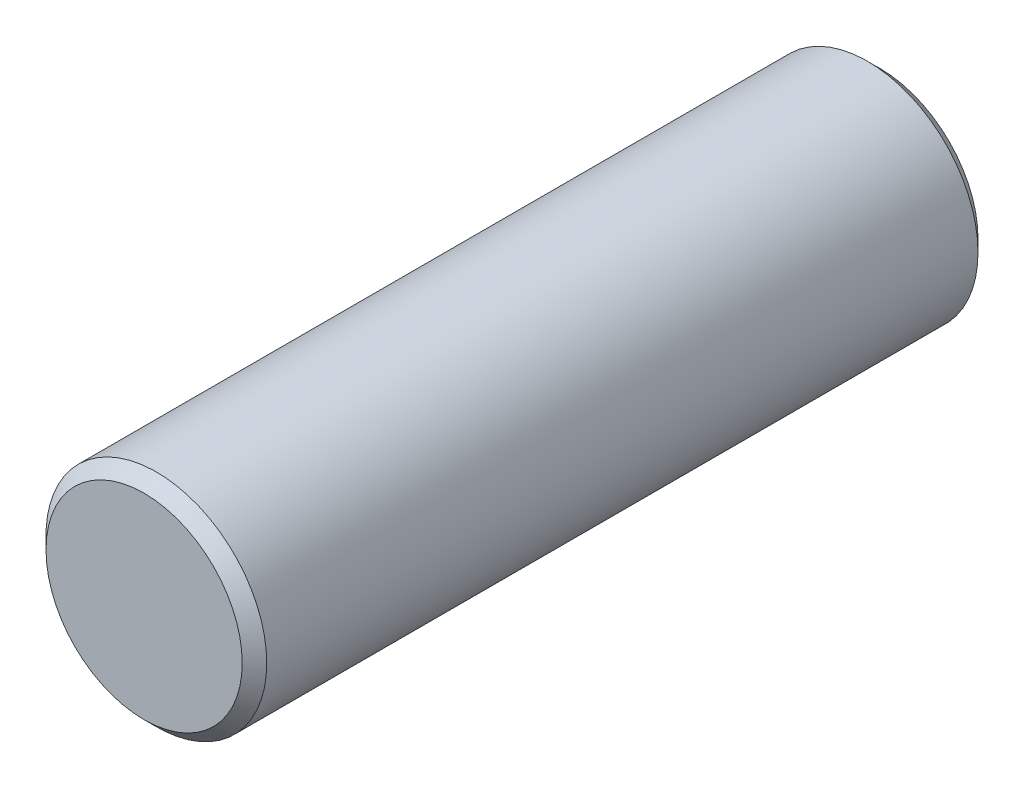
ISO-10303-21;
HEADER;
FILE_DESCRIPTION(('STEP AP214'),'2;1');
FILE_NAME('part.step','',(''),(''),'','','');
FILE_SCHEMA(('AUTOMOTIVE_DESIGN { 1 0 10303 214 1 1 1 1 }'));
ENDSEC;
DATA;
#1=APPLICATION_CONTEXT('core data for automotive mechanical design processes');
#2=APPLICATION_PROTOCOL_DEFINITION('international standard','automotive_design',2000,#1);
#3=PRODUCT_CONTEXT('',#1,'mechanical');
#4=PRODUCT('Part','Part','',(#3));
#5=PRODUCT_RELATED_PRODUCT_CATEGORY('part','',(#4));
#6=PRODUCT_DEFINITION_FORMATION('','',#4);
#7=PRODUCT_DEFINITION_CONTEXT('part definition',#1,'design');
#8=PRODUCT_DEFINITION('design','',#6,#7);
#9=PRODUCT_DEFINITION_SHAPE('','',#8);
#10=(LENGTH_UNIT() NAMED_UNIT(*) SI_UNIT(.MILLI.,.METRE.));
#11=(NAMED_UNIT(*) PLANE_ANGLE_UNIT() SI_UNIT($,.RADIAN.));
#12=(NAMED_UNIT(*) SI_UNIT($,.STERADIAN.) SOLID_ANGLE_UNIT());
#13=UNCERTAINTY_MEASURE_WITH_UNIT(LENGTH_MEASURE(1.E-05),#10,'distance_accuracy_value','');
#14=(GEOMETRIC_REPRESENTATION_CONTEXT(3) GLOBAL_UNCERTAINTY_ASSIGNED_CONTEXT((#13)) GLOBAL_UNIT_ASSIGNED_CONTEXT((#10,
#11,#12)) REPRESENTATION_CONTEXT('',''));
#15=CARTESIAN_POINT('',(0.,0.,0.));
#16=DIRECTION('',(0.,0.,1.));
#17=DIRECTION('',(1.,0.,0.));
#18=AXIS2_PLACEMENT_3D('',#15,#16,#17);
#19=CARTESIAN_POINT('',(0.,0.,60.));
#20=DIRECTION('',(0.,0.,-1.));
#21=DIRECTION('',(-1.,0.,0.));
#22=AXIS2_PLACEMENT_3D('',#19,#20,#21);
#23=CYLINDRICAL_SURFACE('',#22,9.);
#24=CARTESIAN_POINT('',(0.,0.,1.00000000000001));
#25=DIRECTION('',(0.,0.,1.));
#26=DIRECTION('',(1.,0.,0.));
#27=AXIS2_PLACEMENT_3D('',#24,#25,#26);
#28=CIRCLE('',#27,9.);
#29=CARTESIAN_POINT('',(9.,0.,1.00000000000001));
#30=VERTEX_POINT('',#29);
#31=EDGE_CURVE('E39',#30,#30,#28,.T.);
#32=ORIENTED_EDGE('',*,*,#31,.T.);
#33=EDGE_LOOP('',(#32));
#34=FACE_BOUND('',#33,.T.);
#35=CARTESIAN_POINT('',(0.,0.,59.));
#36=DIRECTION('',(0.,0.,1.));
#37=DIRECTION('',(1.,0.,0.));
#38=AXIS2_PLACEMENT_3D('',#35,#36,#37);
#39=CIRCLE('',#38,9.);
#40=CARTESIAN_POINT('',(9.,0.,59.));
#41=VERTEX_POINT('',#40);
#42=EDGE_CURVE('E43',#41,#41,#39,.F.);
#43=ORIENTED_EDGE('',*,*,#42,.T.);
#44=EDGE_LOOP('',(#43));
#45=FACE_BOUND('',#44,.T.);
#46=ADVANCED_FACE('F28',(#34,#45),#23,.T.);
#47=CARTESIAN_POINT('',(0.,0.,60.));
#48=DIRECTION('',(0.,0.,1.));
#49=DIRECTION('',(1.,0.,0.));
#50=AXIS2_PLACEMENT_3D('',#47,#48,#49);
#51=PLANE('',#50);
#52=CARTESIAN_POINT('',(0.,0.,60.));
#53=DIRECTION('',(0.,0.,1.));
#54=DIRECTION('',(1.,0.,0.));
#55=AXIS2_PLACEMENT_3D('',#52,#53,#54);
#56=CIRCLE('',#55,8.00000000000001);
#57=CARTESIAN_POINT('',(8.00000000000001,0.,60.));
#58=VERTEX_POINT('',#57);
#59=EDGE_CURVE('E10',#58,#58,#56,.T.);
#60=ORIENTED_EDGE('',*,*,#59,.T.);
#61=EDGE_LOOP('',(#60));
#62=FACE_BOUND('',#61,.T.);
#63=ADVANCED_FACE('F59',(#62),#51,.T.);
#64=CARTESIAN_POINT('',(0.,0.,0.));
#65=DIRECTION('',(0.,0.,1.));
#66=DIRECTION('',(1.,0.,0.));
#67=AXIS2_PLACEMENT_3D('',#64,#65,#66);
#68=PLANE('',#67);
#69=CARTESIAN_POINT('',(0.,0.,0.));
#70=DIRECTION('',(0.,0.,1.));
#71=DIRECTION('',(1.,0.,0.));
#72=AXIS2_PLACEMENT_3D('',#69,#70,#71);
#73=CIRCLE('',#72,7.99999999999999);
#74=CARTESIAN_POINT('',(7.99999999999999,0.,0.));
#75=VERTEX_POINT('',#74);
#76=EDGE_CURVE('E35',#75,#75,#73,.F.);
#77=ORIENTED_EDGE('',*,*,#76,.T.);
#78=EDGE_LOOP('',(#77));
#79=FACE_BOUND('',#78,.T.);
#80=ADVANCED_FACE('F56',(#79),#68,.F.);
#81=CARTESIAN_POINT('',(0.,0.,1.00000000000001));
#82=DIRECTION('',(0.,0.,1.));
#83=DIRECTION('',(1.,0.,0.));
#84=AXIS2_PLACEMENT_3D('',#81,#82,#83);
#85=CONICAL_SURFACE('',#84,9.,0.785398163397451);
#86=ORIENTED_EDGE('',*,*,#76,.F.);
#87=EDGE_LOOP('',(#86));
#88=FACE_BOUND('',#87,.T.);
#89=ORIENTED_EDGE('',*,*,#31,.F.);
#90=EDGE_LOOP('',(#89));
#91=FACE_BOUND('',#90,.T.);
#92=ADVANCED_FACE('F52',(#88,#91),#85,.T.);
#93=CARTESIAN_POINT('',(0.,0.,60.));
#94=DIRECTION('',(0.,0.,-1.));
#95=DIRECTION('',(-1.,0.,0.));
#96=AXIS2_PLACEMENT_3D('',#93,#94,#95);
#97=CONICAL_SURFACE('',#96,8.00000000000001,0.785398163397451);
#98=ORIENTED_EDGE('',*,*,#42,.F.);
#99=EDGE_LOOP('',(#98));
#100=FACE_BOUND('',#99,.T.);
#101=ORIENTED_EDGE('',*,*,#59,.F.);
#102=EDGE_LOOP('',(#101));
#103=FACE_BOUND('',#102,.T.);
#104=ADVANCED_FACE('F30',(#100,#103),#97,.T.);
#105=CLOSED_SHELL('',(#46,#63,#80,#92,#104));
#106=MANIFOLD_SOLID_BREP('B2',#105);
#107=ADVANCED_BREP_SHAPE_REPRESENTATION('',(#18,#106),#14);
#108=SHAPE_DEFINITION_REPRESENTATION(#9,#107);
ENDSEC;
END-ISO-10303-21;
